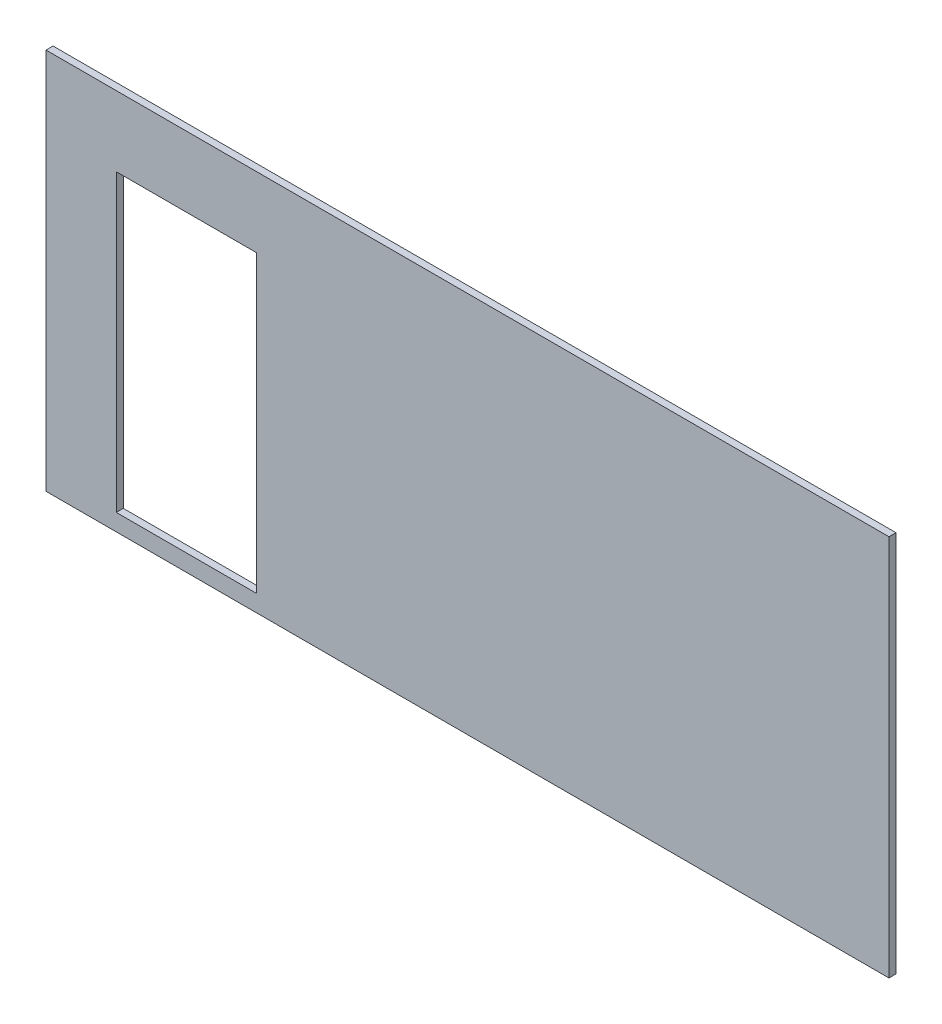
ISO-10303-21;
HEADER;
FILE_DESCRIPTION(('STEP AP214'),'2;1');
FILE_NAME('part.step','',(''),(''),'','','');
FILE_SCHEMA(('AUTOMOTIVE_DESIGN { 1 0 10303 214 1 1 1 1 }'));
ENDSEC;
DATA;
#1=APPLICATION_CONTEXT('core data for automotive mechanical design processes');
#2=APPLICATION_PROTOCOL_DEFINITION('international standard','automotive_design',2000,#1);
#3=PRODUCT_CONTEXT('',#1,'mechanical');
#4=PRODUCT('Part','Part','',(#3));
#5=PRODUCT_RELATED_PRODUCT_CATEGORY('part','',(#4));
#6=PRODUCT_DEFINITION_FORMATION('','',#4);
#7=PRODUCT_DEFINITION_CONTEXT('part definition',#1,'design');
#8=PRODUCT_DEFINITION('design','',#6,#7);
#9=PRODUCT_DEFINITION_SHAPE('','',#8);
#10=(LENGTH_UNIT() NAMED_UNIT(*) SI_UNIT(.MILLI.,.METRE.));
#11=(NAMED_UNIT(*) PLANE_ANGLE_UNIT() SI_UNIT($,.RADIAN.));
#12=(NAMED_UNIT(*) SI_UNIT($,.STERADIAN.) SOLID_ANGLE_UNIT());
#13=UNCERTAINTY_MEASURE_WITH_UNIT(LENGTH_MEASURE(1.E-05),#10,'distance_accuracy_value','');
#14=(GEOMETRIC_REPRESENTATION_CONTEXT(3) GLOBAL_UNCERTAINTY_ASSIGNED_CONTEXT((#13)) GLOBAL_UNIT_ASSIGNED_CONTEXT((#10,
#11,#12)) REPRESENTATION_CONTEXT('',''));
#15=CARTESIAN_POINT('',(0.,0.,0.));
#16=DIRECTION('',(0.,0.,1.));
#17=DIRECTION('',(1.,0.,0.));
#18=AXIS2_PLACEMENT_3D('',#15,#16,#17);
#19=CARTESIAN_POINT('',(-241.058406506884,222.,5.));
#20=DIRECTION('',(0.,-1.,0.));
#21=DIRECTION('',(1.,0.,0.));
#22=AXIS2_PLACEMENT_3D('',#19,#20,#21);
#23=PLANE('',#22);
#24=DIRECTION('',(-1.,0.,0.));
#25=VECTOR('',#24,1.);
#26=CARTESIAN_POINT('',(-241.058406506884,222.,0.));
#27=LINE('',#26,#25);
#28=CARTESIAN_POINT('',(121.489416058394,222.,0.));
#29=VERTEX_POINT('',#28);
#30=CARTESIAN_POINT('',(21.4894160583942,222.,0.));
#31=VERTEX_POINT('',#30);
#32=EDGE_CURVE('E121',#29,#31,#27,.T.);
#33=ORIENTED_EDGE('',*,*,#32,.F.);
#34=DIRECTION('',(0.,0.,-1.));
#35=VECTOR('',#34,1.);
#36=CARTESIAN_POINT('',(121.489416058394,222.,5.));
#37=LINE('',#36,#35);
#38=CARTESIAN_POINT('',(121.489416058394,222.,5.));
#39=VERTEX_POINT('',#38);
#40=EDGE_CURVE('E11',#39,#29,#37,.T.);
#41=ORIENTED_EDGE('',*,*,#40,.F.);
#42=DIRECTION('',(-1.,0.,0.));
#43=VECTOR('',#42,1.);
#44=CARTESIAN_POINT('',(-241.058406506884,222.,5.));
#45=LINE('',#44,#43);
#46=CARTESIAN_POINT('',(21.4894160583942,222.,5.));
#47=VERTEX_POINT('',#46);
#48=EDGE_CURVE('E142',#39,#47,#45,.T.);
#49=ORIENTED_EDGE('',*,*,#48,.T.);
#50=DIRECTION('',(0.,0.,-1.));
#51=VECTOR('',#50,1.);
#52=CARTESIAN_POINT('',(21.4894160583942,222.,5.));
#53=LINE('',#52,#51);
#54=EDGE_CURVE('E43',#47,#31,#53,.T.);
#55=ORIENTED_EDGE('',*,*,#54,.T.);
#56=EDGE_LOOP('',(#33,#41,#49,#55));
#57=FACE_BOUND('',#56,.T.);
#58=ADVANCED_FACE('F26',(#57),#23,.T.);
#59=CARTESIAN_POINT('',(121.489416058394,136.,5.));
#60=DIRECTION('',(1.,0.,0.));
#61=DIRECTION('',(0.,0.,-1.));
#62=AXIS2_PLACEMENT_3D('',#59,#60,#61);
#63=PLANE('',#62);
#64=DIRECTION('',(0.,-1.,0.));
#65=VECTOR('',#64,1.);
#66=CARTESIAN_POINT('',(121.489416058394,136.,0.));
#67=LINE('',#66,#65);
#68=CARTESIAN_POINT('',(121.489416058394,12.0000000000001,0.));
#69=VERTEX_POINT('',#68);
#70=EDGE_CURVE('E124',#29,#69,#67,.T.);
#71=ORIENTED_EDGE('',*,*,#70,.T.);
#72=DIRECTION('',(0.,0.,-1.));
#73=VECTOR('',#72,1.);
#74=CARTESIAN_POINT('',(121.489416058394,12.0000000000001,5.));
#75=LINE('',#74,#73);
#76=CARTESIAN_POINT('',(121.489416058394,12.0000000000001,5.));
#77=VERTEX_POINT('',#76);
#78=EDGE_CURVE('E35',#77,#69,#75,.T.);
#79=ORIENTED_EDGE('',*,*,#78,.F.);
#80=DIRECTION('',(0.,-1.,0.));
#81=VECTOR('',#80,1.);
#82=CARTESIAN_POINT('',(121.489416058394,136.,5.));
#83=LINE('',#82,#81);
#84=EDGE_CURVE('E144',#39,#77,#83,.T.);
#85=ORIENTED_EDGE('',*,*,#84,.F.);
#86=ORIENTED_EDGE('',*,*,#40,.T.);
#87=EDGE_LOOP('',(#71,#79,#85,#86));
#88=FACE_BOUND('',#87,.T.);
#89=ADVANCED_FACE('F175',(#88),#63,.F.);
#90=CARTESIAN_POINT('',(-241.058406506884,12.0000000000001,5.));
#91=DIRECTION('',(0.,-1.,0.));
#92=DIRECTION('',(0.,0.,-1.));
#93=AXIS2_PLACEMENT_3D('',#90,#91,#92);
#94=PLANE('',#93);
#95=DIRECTION('',(-1.,0.,0.));
#96=VECTOR('',#95,1.);
#97=CARTESIAN_POINT('',(-241.058406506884,12.0000000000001,0.));
#98=LINE('',#97,#96);
#99=CARTESIAN_POINT('',(21.4894160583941,12.0000000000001,0.));
#100=VERTEX_POINT('',#99);
#101=EDGE_CURVE('E127',#69,#100,#98,.T.);
#102=ORIENTED_EDGE('',*,*,#101,.T.);
#103=DIRECTION('',(0.,0.,-1.));
#104=VECTOR('',#103,1.);
#105=CARTESIAN_POINT('',(21.4894160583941,12.0000000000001,5.));
#106=LINE('',#105,#104);
#107=CARTESIAN_POINT('',(21.4894160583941,12.0000000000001,5.));
#108=VERTEX_POINT('',#107);
#109=EDGE_CURVE('E150',#108,#100,#106,.T.);
#110=ORIENTED_EDGE('',*,*,#109,.F.);
#111=DIRECTION('',(-1.,0.,0.));
#112=VECTOR('',#111,1.);
#113=CARTESIAN_POINT('',(-241.058406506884,12.0000000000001,5.));
#114=LINE('',#113,#112);
#115=EDGE_CURVE('E51',#77,#108,#114,.T.);
#116=ORIENTED_EDGE('',*,*,#115,.F.);
#117=ORIENTED_EDGE('',*,*,#78,.T.);
#118=EDGE_LOOP('',(#102,#110,#116,#117));
#119=FACE_BOUND('',#118,.T.);
#120=ADVANCED_FACE('F180',(#119),#94,.F.);
#121=CARTESIAN_POINT('',(-241.058406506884,272.,5.));
#122=DIRECTION('',(0.,1.,0.));
#123=DIRECTION('',(0.,0.,1.));
#124=AXIS2_PLACEMENT_3D('',#121,#122,#123);
#125=PLANE('',#124);
#126=DIRECTION('',(1.,0.,0.));
#127=VECTOR('',#126,1.);
#128=CARTESIAN_POINT('',(-241.058406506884,272.,0.));
#129=LINE('',#128,#127);
#130=CARTESIAN_POINT('',(-28.5105839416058,272.,0.));
#131=VERTEX_POINT('',#130);
#132=CARTESIAN_POINT('',(571.489416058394,272.,0.));
#133=VERTEX_POINT('',#132);
#134=EDGE_CURVE('E110',#131,#133,#129,.T.);
#135=ORIENTED_EDGE('',*,*,#134,.F.);
#136=DIRECTION('',(0.,0.,-1.));
#137=VECTOR('',#136,1.);
#138=CARTESIAN_POINT('',(-28.5105839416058,272.,5.));
#139=LINE('',#138,#137);
#140=CARTESIAN_POINT('',(-28.5105839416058,272.,5.));
#141=VERTEX_POINT('',#140);
#142=EDGE_CURVE('E30',#141,#131,#139,.T.);
#143=ORIENTED_EDGE('',*,*,#142,.F.);
#144=DIRECTION('',(1.,0.,0.));
#145=VECTOR('',#144,1.);
#146=CARTESIAN_POINT('',(-241.058406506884,272.,5.));
#147=LINE('',#146,#145);
#148=CARTESIAN_POINT('',(571.489416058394,272.,5.));
#149=VERTEX_POINT('',#148);
#150=EDGE_CURVE('E133',#141,#149,#147,.T.);
#151=ORIENTED_EDGE('',*,*,#150,.T.);
#152=DIRECTION('',(0.,0.,-1.));
#153=VECTOR('',#152,1.);
#154=CARTESIAN_POINT('',(571.489416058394,272.,5.));
#155=LINE('',#154,#153);
#156=EDGE_CURVE('E115',#149,#133,#155,.T.);
#157=ORIENTED_EDGE('',*,*,#156,.T.);
#158=EDGE_LOOP('',(#135,#143,#151,#157));
#159=FACE_BOUND('',#158,.T.);
#160=ADVANCED_FACE('F28',(#159),#125,.T.);
#161=CARTESIAN_POINT('',(-28.5105839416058,136.,5.));
#162=DIRECTION('',(1.,0.,0.));
#163=DIRECTION('',(0.,0.,-1.));
#164=AXIS2_PLACEMENT_3D('',#161,#162,#163);
#165=PLANE('',#164);
#166=DIRECTION('',(0.,-1.,0.));
#167=VECTOR('',#166,1.);
#168=CARTESIAN_POINT('',(-28.5105839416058,136.,0.));
#169=LINE('',#168,#167);
#170=CARTESIAN_POINT('',(-28.5105839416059,0.,0.));
#171=VERTEX_POINT('',#170);
#172=EDGE_CURVE('E97',#131,#171,#169,.T.);
#173=ORIENTED_EDGE('',*,*,#172,.T.);
#174=DIRECTION('',(0.,0.,-1.));
#175=VECTOR('',#174,1.);
#176=CARTESIAN_POINT('',(-28.5105839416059,0.,5.));
#177=LINE('',#176,#175);
#178=CARTESIAN_POINT('',(-28.5105839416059,0.,5.));
#179=VERTEX_POINT('',#178);
#180=EDGE_CURVE('E104',#179,#171,#177,.T.);
#181=ORIENTED_EDGE('',*,*,#180,.F.);
#182=DIRECTION('',(0.,-1.,0.));
#183=VECTOR('',#182,1.);
#184=CARTESIAN_POINT('',(-28.5105839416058,136.,5.));
#185=LINE('',#184,#183);
#186=EDGE_CURVE('E99',#141,#179,#185,.T.);
#187=ORIENTED_EDGE('',*,*,#186,.F.);
#188=ORIENTED_EDGE('',*,*,#142,.T.);
#189=EDGE_LOOP('',(#173,#181,#187,#188));
#190=FACE_BOUND('',#189,.T.);
#191=ADVANCED_FACE('F95',(#190),#165,.F.);
#192=CARTESIAN_POINT('',(-241.058406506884,0.,5.));
#193=DIRECTION('',(0.,-1.,0.));
#194=DIRECTION('',(0.,0.,-1.));
#195=AXIS2_PLACEMENT_3D('',#192,#193,#194);
#196=PLANE('',#195);
#197=DIRECTION('',(-1.,0.,0.));
#198=VECTOR('',#197,1.);
#199=CARTESIAN_POINT('',(-241.058406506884,0.,0.));
#200=LINE('',#199,#198);
#201=CARTESIAN_POINT('',(571.489416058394,0.,0.));
#202=VERTEX_POINT('',#201);
#203=EDGE_CURVE('E113',#202,#171,#200,.T.);
#204=ORIENTED_EDGE('',*,*,#203,.F.);
#205=DIRECTION('',(0.,0.,-1.));
#206=VECTOR('',#205,1.);
#207=CARTESIAN_POINT('',(571.489416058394,0.,5.));
#208=LINE('',#207,#206);
#209=CARTESIAN_POINT('',(571.489416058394,0.,5.));
#210=VERTEX_POINT('',#209);
#211=EDGE_CURVE('E155',#210,#202,#208,.T.);
#212=ORIENTED_EDGE('',*,*,#211,.F.);
#213=DIRECTION('',(-1.,0.,0.));
#214=VECTOR('',#213,1.);
#215=CARTESIAN_POINT('',(-241.058406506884,0.,5.));
#216=LINE('',#215,#214);
#217=EDGE_CURVE('E136',#210,#179,#216,.T.);
#218=ORIENTED_EDGE('',*,*,#217,.T.);
#219=ORIENTED_EDGE('',*,*,#180,.T.);
#220=EDGE_LOOP('',(#204,#212,#218,#219));
#221=FACE_BOUND('',#220,.T.);
#222=ADVANCED_FACE('F157',(#221),#196,.T.);
#223=CARTESIAN_POINT('',(571.489416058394,136.,5.));
#224=DIRECTION('',(1.,0.,0.));
#225=DIRECTION('',(0.,0.,-1.));
#226=AXIS2_PLACEMENT_3D('',#223,#224,#225);
#227=PLANE('',#226);
#228=DIRECTION('',(0.,-1.,0.));
#229=VECTOR('',#228,1.);
#230=CARTESIAN_POINT('',(571.489416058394,136.,0.));
#231=LINE('',#230,#229);
#232=EDGE_CURVE('E119',#133,#202,#231,.T.);
#233=ORIENTED_EDGE('',*,*,#232,.F.);
#234=ORIENTED_EDGE('',*,*,#156,.F.);
#235=DIRECTION('',(0.,-1.,0.));
#236=VECTOR('',#235,1.);
#237=CARTESIAN_POINT('',(571.489416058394,136.,5.));
#238=LINE('',#237,#236);
#239=EDGE_CURVE('E139',#149,#210,#238,.T.);
#240=ORIENTED_EDGE('',*,*,#239,.T.);
#241=ORIENTED_EDGE('',*,*,#211,.T.);
#242=EDGE_LOOP('',(#233,#234,#240,#241));
#243=FACE_BOUND('',#242,.T.);
#244=ADVANCED_FACE('F163',(#243),#227,.T.);
#245=CARTESIAN_POINT('',(21.4894160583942,136.,5.));
#246=DIRECTION('',(1.,0.,0.));
#247=DIRECTION('',(0.,0.,-1.));
#248=AXIS2_PLACEMENT_3D('',#245,#246,#247);
#249=PLANE('',#248);
#250=DIRECTION('',(0.,-1.,0.));
#251=VECTOR('',#250,1.);
#252=CARTESIAN_POINT('',(21.4894160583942,136.,0.));
#253=LINE('',#252,#251);
#254=EDGE_CURVE('E130',#31,#100,#253,.T.);
#255=ORIENTED_EDGE('',*,*,#254,.F.);
#256=ORIENTED_EDGE('',*,*,#54,.F.);
#257=DIRECTION('',(0.,-1.,0.));
#258=VECTOR('',#257,1.);
#259=CARTESIAN_POINT('',(21.4894160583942,136.,5.));
#260=LINE('',#259,#258);
#261=EDGE_CURVE('E147',#47,#108,#260,.T.);
#262=ORIENTED_EDGE('',*,*,#261,.T.);
#263=ORIENTED_EDGE('',*,*,#109,.T.);
#264=EDGE_LOOP('',(#255,#256,#262,#263));
#265=FACE_BOUND('',#264,.T.);
#266=ADVANCED_FACE('F165',(#265),#249,.T.);
#267=CARTESIAN_POINT('',(-241.058406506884,136.,5.));
#268=DIRECTION('',(0.,0.,-1.));
#269=DIRECTION('',(-1.,0.,0.));
#270=AXIS2_PLACEMENT_3D('',#267,#268,#269);
#271=PLANE('',#270);
#272=ORIENTED_EDGE('',*,*,#150,.F.);
#273=ORIENTED_EDGE('',*,*,#186,.T.);
#274=ORIENTED_EDGE('',*,*,#217,.F.);
#275=ORIENTED_EDGE('',*,*,#239,.F.);
#276=EDGE_LOOP('',(#272,#273,#274,#275));
#277=FACE_BOUND('',#276,.T.);
#278=ORIENTED_EDGE('',*,*,#48,.F.);
#279=ORIENTED_EDGE('',*,*,#84,.T.);
#280=ORIENTED_EDGE('',*,*,#115,.T.);
#281=ORIENTED_EDGE('',*,*,#261,.F.);
#282=EDGE_LOOP('',(#278,#279,#280,#281));
#283=FACE_BOUND('',#282,.T.);
#284=ADVANCED_FACE('F161',(#277,#283),#271,.F.);
#285=CARTESIAN_POINT('',(-241.058406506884,136.,0.));
#286=DIRECTION('',(0.,0.,-1.));
#287=DIRECTION('',(-1.,0.,0.));
#288=AXIS2_PLACEMENT_3D('',#285,#286,#287);
#289=PLANE('',#288);
#290=ORIENTED_EDGE('',*,*,#134,.T.);
#291=ORIENTED_EDGE('',*,*,#232,.T.);
#292=ORIENTED_EDGE('',*,*,#203,.T.);
#293=ORIENTED_EDGE('',*,*,#172,.F.);
#294=EDGE_LOOP('',(#290,#291,#292,#293));
#295=FACE_BOUND('',#294,.T.);
#296=ORIENTED_EDGE('',*,*,#32,.T.);
#297=ORIENTED_EDGE('',*,*,#254,.T.);
#298=ORIENTED_EDGE('',*,*,#101,.F.);
#299=ORIENTED_EDGE('',*,*,#70,.F.);
#300=EDGE_LOOP('',(#296,#297,#298,#299));
#301=FACE_BOUND('',#300,.T.);
#302=ADVANCED_FACE('F107',(#295,#301),#289,.T.);
#303=CLOSED_SHELL('',(#58,#89,#120,#160,#191,#222,#244,#266,#284,#302));
#304=MANIFOLD_SOLID_BREP('B2',#303);
#305=ADVANCED_BREP_SHAPE_REPRESENTATION('',(#18,#304),#14);
#306=SHAPE_DEFINITION_REPRESENTATION(#9,#305);
ENDSEC;
END-ISO-10303-21;
